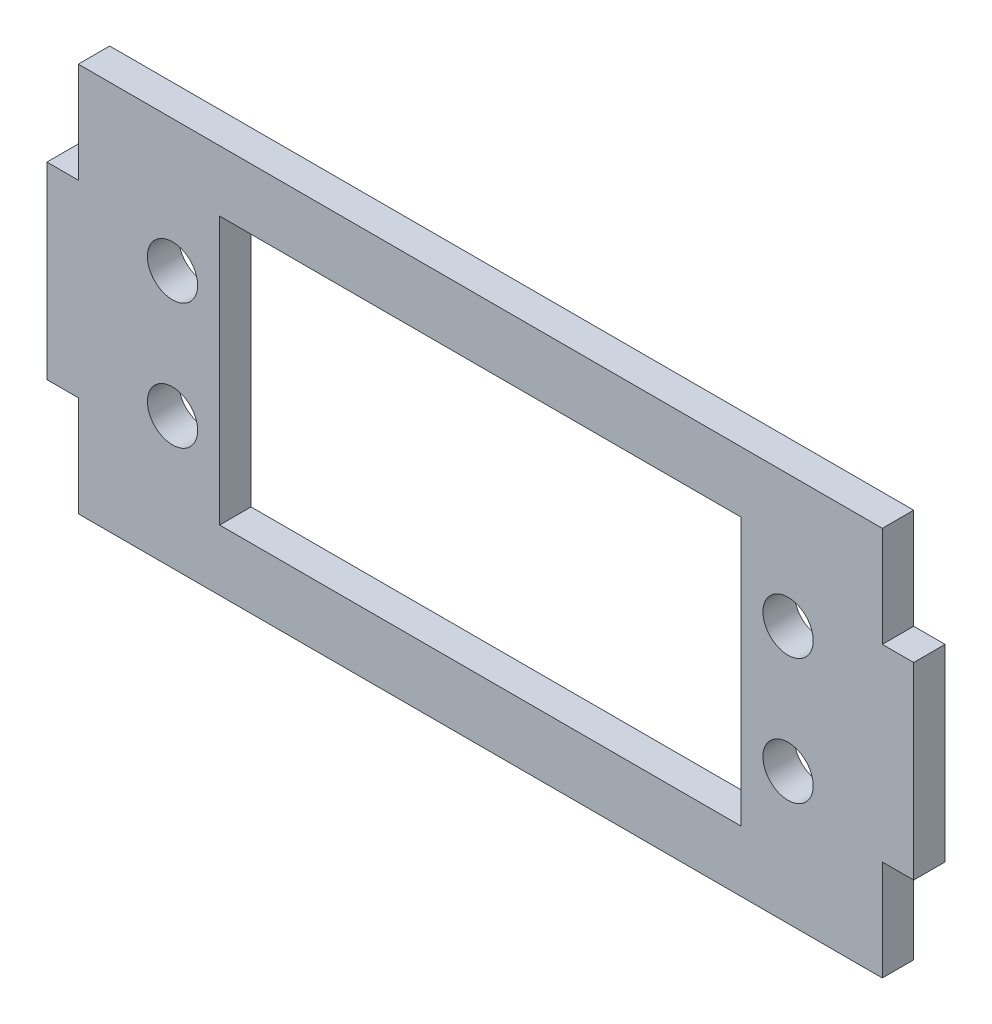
ISO-10303-21;
HEADER;
FILE_DESCRIPTION(('STEP AP214'),'2;1');
FILE_NAME('part.step','',(''),(''),'','','');
FILE_SCHEMA(('AUTOMOTIVE_DESIGN { 1 0 10303 214 1 1 1 1 }'));
ENDSEC;
DATA;
#1=APPLICATION_CONTEXT('core data for automotive mechanical design processes');
#2=APPLICATION_PROTOCOL_DEFINITION('international standard','automotive_design',2000,#1);
#3=PRODUCT_CONTEXT('',#1,'mechanical');
#4=PRODUCT('Part','Part','',(#3));
#5=PRODUCT_RELATED_PRODUCT_CATEGORY('part','',(#4));
#6=PRODUCT_DEFINITION_FORMATION('','',#4);
#7=PRODUCT_DEFINITION_CONTEXT('part definition',#1,'design');
#8=PRODUCT_DEFINITION('design','',#6,#7);
#9=PRODUCT_DEFINITION_SHAPE('','',#8);
#10=(LENGTH_UNIT() NAMED_UNIT(*) SI_UNIT(.MILLI.,.METRE.));
#11=(NAMED_UNIT(*) PLANE_ANGLE_UNIT() SI_UNIT($,.RADIAN.));
#12=(NAMED_UNIT(*) SI_UNIT($,.STERADIAN.) SOLID_ANGLE_UNIT());
#13=UNCERTAINTY_MEASURE_WITH_UNIT(LENGTH_MEASURE(1.E-05),#10,'distance_accuracy_value','');
#14=(GEOMETRIC_REPRESENTATION_CONTEXT(3) GLOBAL_UNCERTAINTY_ASSIGNED_CONTEXT((#13)) GLOBAL_UNIT_ASSIGNED_CONTEXT((#10,
#11,#12)) REPRESENTATION_CONTEXT('',''));
#15=CARTESIAN_POINT('',(0.,0.,0.));
#16=DIRECTION('',(0.,0.,1.));
#17=DIRECTION('',(1.,0.,0.));
#18=AXIS2_PLACEMENT_3D('',#15,#16,#17);
#19=CARTESIAN_POINT('',(0.,0.,2.5));
#20=DIRECTION('',(0.,0.,-1.));
#21=DIRECTION('',(-1.,0.,0.));
#22=AXIS2_PLACEMENT_3D('',#19,#20,#21);
#23=PLANE('',#22);
#24=CARTESIAN_POINT('',(34.5,5.,2.5));
#25=DIRECTION('',(0.,0.,-1.));
#26=DIRECTION('',(-1.,0.,0.));
#27=AXIS2_PLACEMENT_3D('',#24,#25,#26);
#28=CIRCLE('',#27,2.0000000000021);
#29=CARTESIAN_POINT('',(32.4999999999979,5.,2.5));
#30=VERTEX_POINT('',#29);
#31=EDGE_CURVE('E178',#30,#30,#28,.T.);
#32=ORIENTED_EDGE('',*,*,#31,.T.);
#33=EDGE_LOOP('',(#32));
#34=FACE_BOUND('',#33,.T.);
#35=CARTESIAN_POINT('',(34.5,-5.,2.5));
#36=DIRECTION('',(0.,0.,-1.));
#37=DIRECTION('',(-1.,0.,0.));
#38=AXIS2_PLACEMENT_3D('',#35,#36,#37);
#39=CIRCLE('',#38,2.);
#40=CARTESIAN_POINT('',(32.5,-5.,2.5));
#41=VERTEX_POINT('',#40);
#42=EDGE_CURVE('E566',#41,#41,#39,.T.);
#43=ORIENTED_EDGE('',*,*,#42,.T.);
#44=EDGE_LOOP('',(#43));
#45=FACE_BOUND('',#44,.T.);
#46=CARTESIAN_POINT('',(-14.5,-5.,2.5));
#47=DIRECTION('',(0.,0.,-1.));
#48=DIRECTION('',(-1.,0.,0.));
#49=AXIS2_PLACEMENT_3D('',#46,#47,#48);
#50=CIRCLE('',#49,2.);
#51=CARTESIAN_POINT('',(-16.5,-5.,2.5));
#52=VERTEX_POINT('',#51);
#53=EDGE_CURVE('E568',#52,#52,#50,.T.);
#54=ORIENTED_EDGE('',*,*,#53,.T.);
#55=EDGE_LOOP('',(#54));
#56=FACE_BOUND('',#55,.T.);
#57=CARTESIAN_POINT('',(-14.5,5.,2.5));
#58=DIRECTION('',(0.,0.,-1.));
#59=DIRECTION('',(-1.,0.,0.));
#60=AXIS2_PLACEMENT_3D('',#57,#58,#59);
#61=CIRCLE('',#60,2.0000000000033);
#62=CARTESIAN_POINT('',(-16.5000000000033,5.,2.5));
#63=VERTEX_POINT('',#62);
#64=EDGE_CURVE('E573',#63,#63,#61,.T.);
#65=ORIENTED_EDGE('',*,*,#64,.T.);
#66=EDGE_LOOP('',(#65));
#67=FACE_BOUND('',#66,.T.);
#68=DIRECTION('',(0.,-1.,0.));
#69=VECTOR('',#68,1.);
#70=CARTESIAN_POINT('',(-22.,15.5,2.5));
#71=LINE('',#70,#69);
#72=CARTESIAN_POINT('',(-22.,15.5,2.5));
#73=VERTEX_POINT('',#72);
#74=CARTESIAN_POINT('',(-22.,7.5,2.5));
#75=VERTEX_POINT('',#74);
#76=EDGE_CURVE('E188',#73,#75,#71,.T.);
#77=ORIENTED_EDGE('',*,*,#76,.T.);
#78=DIRECTION('',(-1.,0.,0.));
#79=VECTOR('',#78,1.);
#80=CARTESIAN_POINT('',(-22.,7.5,2.5));
#81=LINE('',#80,#79);
#82=CARTESIAN_POINT('',(-24.5,7.5,2.5));
#83=VERTEX_POINT('',#82);
#84=EDGE_CURVE('E191',#75,#83,#81,.T.);
#85=ORIENTED_EDGE('',*,*,#84,.T.);
#86=DIRECTION('',(0.,-1.,0.));
#87=VECTOR('',#86,1.);
#88=CARTESIAN_POINT('',(-24.5,7.5,2.5));
#89=LINE('',#88,#87);
#90=CARTESIAN_POINT('',(-24.5,-7.5,2.5));
#91=VERTEX_POINT('',#90);
#92=EDGE_CURVE('E194',#83,#91,#89,.T.);
#93=ORIENTED_EDGE('',*,*,#92,.T.);
#94=DIRECTION('',(1.,0.,0.));
#95=VECTOR('',#94,1.);
#96=CARTESIAN_POINT('',(-22.,-7.5,2.5));
#97=LINE('',#96,#95);
#98=CARTESIAN_POINT('',(-22.,-7.5,2.5));
#99=VERTEX_POINT('',#98);
#100=EDGE_CURVE('E196',#91,#99,#97,.T.);
#101=ORIENTED_EDGE('',*,*,#100,.T.);
#102=DIRECTION('',(0.,-1.,0.));
#103=VECTOR('',#102,1.);
#104=CARTESIAN_POINT('',(-22.,-7.5,2.5));
#105=LINE('',#104,#103);
#106=CARTESIAN_POINT('',(-22.,-15.5,2.5));
#107=VERTEX_POINT('',#106);
#108=EDGE_CURVE('E198',#99,#107,#105,.T.);
#109=ORIENTED_EDGE('',*,*,#108,.T.);
#110=DIRECTION('',(1.,0.,0.));
#111=VECTOR('',#110,1.);
#112=CARTESIAN_POINT('',(-22.,-15.5,2.5));
#113=LINE('',#112,#111);
#114=CARTESIAN_POINT('',(42.,-15.5,2.5));
#115=VERTEX_POINT('',#114);
#116=EDGE_CURVE('E200',#107,#115,#113,.T.);
#117=ORIENTED_EDGE('',*,*,#116,.T.);
#118=DIRECTION('',(0.,1.,0.));
#119=VECTOR('',#118,1.);
#120=CARTESIAN_POINT('',(42.,-7.49999999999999,2.5));
#121=LINE('',#120,#119);
#122=CARTESIAN_POINT('',(42.,-7.49999999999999,2.5));
#123=VERTEX_POINT('',#122);
#124=EDGE_CURVE('E202',#115,#123,#121,.T.);
#125=ORIENTED_EDGE('',*,*,#124,.T.);
#126=DIRECTION('',(1.,0.,0.));
#127=VECTOR('',#126,1.);
#128=CARTESIAN_POINT('',(42.,-7.49999999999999,2.5));
#129=LINE('',#128,#127);
#130=CARTESIAN_POINT('',(44.5,-7.49999999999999,2.5));
#131=VERTEX_POINT('',#130);
#132=EDGE_CURVE('E204',#123,#131,#129,.T.);
#133=ORIENTED_EDGE('',*,*,#132,.T.);
#134=DIRECTION('',(0.,1.,0.));
#135=VECTOR('',#134,1.);
#136=CARTESIAN_POINT('',(44.5,7.50000000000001,2.5));
#137=LINE('',#136,#135);
#138=CARTESIAN_POINT('',(44.5,7.50000000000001,2.5));
#139=VERTEX_POINT('',#138);
#140=EDGE_CURVE('E206',#131,#139,#137,.T.);
#141=ORIENTED_EDGE('',*,*,#140,.T.);
#142=DIRECTION('',(-1.,0.,0.));
#143=VECTOR('',#142,1.);
#144=CARTESIAN_POINT('',(42.,7.50000000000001,2.5));
#145=LINE('',#144,#143);
#146=CARTESIAN_POINT('',(42.,7.50000000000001,2.5));
#147=VERTEX_POINT('',#146);
#148=EDGE_CURVE('E208',#139,#147,#145,.T.);
#149=ORIENTED_EDGE('',*,*,#148,.T.);
#150=DIRECTION('',(0.,1.,0.));
#151=VECTOR('',#150,1.);
#152=CARTESIAN_POINT('',(42.,15.5,2.5));
#153=LINE('',#152,#151);
#154=CARTESIAN_POINT('',(42.,15.5,2.5));
#155=VERTEX_POINT('',#154);
#156=EDGE_CURVE('E210',#147,#155,#153,.T.);
#157=ORIENTED_EDGE('',*,*,#156,.T.);
#158=DIRECTION('',(-1.,0.,0.));
#159=VECTOR('',#158,1.);
#160=CARTESIAN_POINT('',(-22.,15.5,2.5));
#161=LINE('',#160,#159);
#162=EDGE_CURVE('E212',#155,#73,#161,.T.);
#163=ORIENTED_EDGE('',*,*,#162,.T.);
#164=EDGE_LOOP('',(#77,#85,#93,#101,#109,#117,#125,#133,#141,#149,#157,#163));
#165=FACE_BOUND('',#164,.T.);
#166=DIRECTION('',(0.,-1.,0.));
#167=VECTOR('',#166,1.);
#168=CARTESIAN_POINT('',(-10.749101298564,10.649101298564,2.5));
#169=LINE('',#168,#167);
#170=CARTESIAN_POINT('',(-10.749101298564,10.649101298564,2.5));
#171=VERTEX_POINT('',#170);
#172=CARTESIAN_POINT('',(-10.749101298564,-10.64910129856,2.5));
#173=VERTEX_POINT('',#172);
#174=EDGE_CURVE('E150',#171,#173,#169,.T.);
#175=ORIENTED_EDGE('',*,*,#174,.F.);
#176=DIRECTION('',(-1.,0.,0.));
#177=VECTOR('',#176,1.);
#178=CARTESIAN_POINT('',(-10.749101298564,10.649101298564,2.5));
#179=LINE('',#178,#177);
#180=CARTESIAN_POINT('',(30.74910129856,10.649101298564,2.5));
#181=VERTEX_POINT('',#180);
#182=EDGE_CURVE('E172',#181,#171,#179,.T.);
#183=ORIENTED_EDGE('',*,*,#182,.F.);
#184=DIRECTION('',(0.,1.,0.));
#185=VECTOR('',#184,1.);
#186=CARTESIAN_POINT('',(30.74910129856,10.649101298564,2.5));
#187=LINE('',#186,#185);
#188=CARTESIAN_POINT('',(30.74910129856,-10.64910129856,2.5));
#189=VERTEX_POINT('',#188);
#190=EDGE_CURVE('E170',#189,#181,#187,.T.);
#191=ORIENTED_EDGE('',*,*,#190,.F.);
#192=DIRECTION('',(1.,0.,0.));
#193=VECTOR('',#192,1.);
#194=CARTESIAN_POINT('',(-10.749101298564,-10.64910129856,2.5));
#195=LINE('',#194,#193);
#196=EDGE_CURVE('E158',#173,#189,#195,.T.);
#197=ORIENTED_EDGE('',*,*,#196,.F.);
#198=EDGE_LOOP('',(#175,#183,#191,#197));
#199=FACE_BOUND('',#198,.T.);
#200=ADVANCED_FACE('F37',(#34,#45,#56,#67,#165,#199),#23,.F.);
#201=CARTESIAN_POINT('',(0.,0.,0.));
#202=DIRECTION('',(0.,0.,-1.));
#203=DIRECTION('',(-1.,0.,0.));
#204=AXIS2_PLACEMENT_3D('',#201,#202,#203);
#205=PLANE('',#204);
#206=CARTESIAN_POINT('',(34.5,5.,0.));
#207=DIRECTION('',(0.,0.,-1.));
#208=DIRECTION('',(-1.,0.,0.));
#209=AXIS2_PLACEMENT_3D('',#206,#207,#208);
#210=CIRCLE('',#209,2.0000000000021);
#211=CARTESIAN_POINT('',(32.4999999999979,5.,0.));
#212=VERTEX_POINT('',#211);
#213=EDGE_CURVE('E564',#212,#212,#210,.T.);
#214=ORIENTED_EDGE('',*,*,#213,.F.);
#215=EDGE_LOOP('',(#214));
#216=FACE_BOUND('',#215,.T.);
#217=CARTESIAN_POINT('',(34.5,-5.,0.));
#218=DIRECTION('',(0.,0.,-1.));
#219=DIRECTION('',(-1.,0.,0.));
#220=AXIS2_PLACEMENT_3D('',#217,#218,#219);
#221=CIRCLE('',#220,2.);
#222=CARTESIAN_POINT('',(32.5,-5.,0.));
#223=VERTEX_POINT('',#222);
#224=EDGE_CURVE('E581',#223,#223,#221,.T.);
#225=ORIENTED_EDGE('',*,*,#224,.F.);
#226=EDGE_LOOP('',(#225));
#227=FACE_BOUND('',#226,.T.);
#228=CARTESIAN_POINT('',(-14.5,-5.,0.));
#229=DIRECTION('',(0.,0.,-1.));
#230=DIRECTION('',(-1.,0.,0.));
#231=AXIS2_PLACEMENT_3D('',#228,#229,#230);
#232=CIRCLE('',#231,2.);
#233=CARTESIAN_POINT('',(-16.5,-5.,0.));
#234=VERTEX_POINT('',#233);
#235=EDGE_CURVE('E579',#234,#234,#232,.T.);
#236=ORIENTED_EDGE('',*,*,#235,.F.);
#237=EDGE_LOOP('',(#236));
#238=FACE_BOUND('',#237,.T.);
#239=CARTESIAN_POINT('',(-14.5,5.,0.));
#240=DIRECTION('',(0.,0.,-1.));
#241=DIRECTION('',(-1.,0.,0.));
#242=AXIS2_PLACEMENT_3D('',#239,#240,#241);
#243=CIRCLE('',#242,2.0000000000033);
#244=CARTESIAN_POINT('',(-16.5000000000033,5.,0.));
#245=VERTEX_POINT('',#244);
#246=EDGE_CURVE('E576',#245,#245,#243,.T.);
#247=ORIENTED_EDGE('',*,*,#246,.F.);
#248=EDGE_LOOP('',(#247));
#249=FACE_BOUND('',#248,.T.);
#250=DIRECTION('',(0.,-1.,0.));
#251=VECTOR('',#250,1.);
#252=CARTESIAN_POINT('',(-22.,15.5,0.));
#253=LINE('',#252,#251);
#254=CARTESIAN_POINT('',(-22.,15.5,0.));
#255=VERTEX_POINT('',#254);
#256=CARTESIAN_POINT('',(-22.,7.5,0.));
#257=VERTEX_POINT('',#256);
#258=EDGE_CURVE('E166',#255,#257,#253,.T.);
#259=ORIENTED_EDGE('',*,*,#258,.F.);
#260=DIRECTION('',(-1.,0.,0.));
#261=VECTOR('',#260,1.);
#262=CARTESIAN_POINT('',(-22.,15.5,0.));
#263=LINE('',#262,#261);
#264=CARTESIAN_POINT('',(42.,15.5,0.));
#265=VERTEX_POINT('',#264);
#266=EDGE_CURVE('E192',#265,#255,#263,.T.);
#267=ORIENTED_EDGE('',*,*,#266,.F.);
#268=DIRECTION('',(0.,1.,0.));
#269=VECTOR('',#268,1.);
#270=CARTESIAN_POINT('',(42.,15.5,0.));
#271=LINE('',#270,#269);
#272=CARTESIAN_POINT('',(42.,7.50000000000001,0.));
#273=VERTEX_POINT('',#272);
#274=EDGE_CURVE('E235',#273,#265,#271,.T.);
#275=ORIENTED_EDGE('',*,*,#274,.F.);
#276=DIRECTION('',(-1.,0.,0.));
#277=VECTOR('',#276,1.);
#278=CARTESIAN_POINT('',(42.,7.50000000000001,0.));
#279=LINE('',#278,#277);
#280=CARTESIAN_POINT('',(44.5,7.50000000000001,0.));
#281=VERTEX_POINT('',#280);
#282=EDGE_CURVE('E233',#281,#273,#279,.T.);
#283=ORIENTED_EDGE('',*,*,#282,.F.);
#284=DIRECTION('',(0.,1.,0.));
#285=VECTOR('',#284,1.);
#286=CARTESIAN_POINT('',(44.5,7.50000000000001,0.));
#287=LINE('',#286,#285);
#288=CARTESIAN_POINT('',(44.5,-7.49999999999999,0.));
#289=VERTEX_POINT('',#288);
#290=EDGE_CURVE('E231',#289,#281,#287,.T.);
#291=ORIENTED_EDGE('',*,*,#290,.F.);
#292=DIRECTION('',(1.,0.,0.));
#293=VECTOR('',#292,1.);
#294=CARTESIAN_POINT('',(42.,-7.49999999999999,0.));
#295=LINE('',#294,#293);
#296=CARTESIAN_POINT('',(42.,-7.49999999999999,0.));
#297=VERTEX_POINT('',#296);
#298=EDGE_CURVE('E229',#297,#289,#295,.T.);
#299=ORIENTED_EDGE('',*,*,#298,.F.);
#300=DIRECTION('',(0.,1.,0.));
#301=VECTOR('',#300,1.);
#302=CARTESIAN_POINT('',(42.,-7.49999999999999,0.));
#303=LINE('',#302,#301);
#304=CARTESIAN_POINT('',(42.,-15.5,0.));
#305=VERTEX_POINT('',#304);
#306=EDGE_CURVE('E227',#305,#297,#303,.T.);
#307=ORIENTED_EDGE('',*,*,#306,.F.);
#308=DIRECTION('',(1.,0.,0.));
#309=VECTOR('',#308,1.);
#310=CARTESIAN_POINT('',(-22.,-15.5,0.));
#311=LINE('',#310,#309);
#312=CARTESIAN_POINT('',(-22.,-15.5,0.));
#313=VERTEX_POINT('',#312);
#314=EDGE_CURVE('E225',#313,#305,#311,.T.);
#315=ORIENTED_EDGE('',*,*,#314,.F.);
#316=DIRECTION('',(0.,-1.,0.));
#317=VECTOR('',#316,1.);
#318=CARTESIAN_POINT('',(-22.,-7.5,0.));
#319=LINE('',#318,#317);
#320=CARTESIAN_POINT('',(-22.,-7.5,0.));
#321=VERTEX_POINT('',#320);
#322=EDGE_CURVE('E223',#321,#313,#319,.T.);
#323=ORIENTED_EDGE('',*,*,#322,.F.);
#324=DIRECTION('',(1.,0.,0.));
#325=VECTOR('',#324,1.);
#326=CARTESIAN_POINT('',(-22.,-7.5,0.));
#327=LINE('',#326,#325);
#328=CARTESIAN_POINT('',(-24.5,-7.5,0.));
#329=VERTEX_POINT('',#328);
#330=EDGE_CURVE('E221',#329,#321,#327,.T.);
#331=ORIENTED_EDGE('',*,*,#330,.F.);
#332=DIRECTION('',(0.,-1.,0.));
#333=VECTOR('',#332,1.);
#334=CARTESIAN_POINT('',(-24.5,7.5,0.));
#335=LINE('',#334,#333);
#336=CARTESIAN_POINT('',(-24.5,7.5,0.));
#337=VERTEX_POINT('',#336);
#338=EDGE_CURVE('E219',#337,#329,#335,.T.);
#339=ORIENTED_EDGE('',*,*,#338,.F.);
#340=DIRECTION('',(-1.,0.,0.));
#341=VECTOR('',#340,1.);
#342=CARTESIAN_POINT('',(-22.,7.5,0.));
#343=LINE('',#342,#341);
#344=EDGE_CURVE('E217',#257,#337,#343,.T.);
#345=ORIENTED_EDGE('',*,*,#344,.F.);
#346=EDGE_LOOP('',(#259,#267,#275,#283,#291,#299,#307,#315,#323,#331,#339,#345));
#347=FACE_BOUND('',#346,.T.);
#348=DIRECTION('',(-1.,0.,0.));
#349=VECTOR('',#348,1.);
#350=CARTESIAN_POINT('',(-10.749101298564,10.649101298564,0.));
#351=LINE('',#350,#349);
#352=CARTESIAN_POINT('',(30.74910129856,10.649101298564,0.));
#353=VERTEX_POINT('',#352);
#354=CARTESIAN_POINT('',(-10.749101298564,10.649101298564,0.));
#355=VERTEX_POINT('',#354);
#356=EDGE_CURVE('E159',#353,#355,#351,.T.);
#357=ORIENTED_EDGE('',*,*,#356,.T.);
#358=DIRECTION('',(0.,-1.,0.));
#359=VECTOR('',#358,1.);
#360=CARTESIAN_POINT('',(-10.749101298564,10.649101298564,0.));
#361=LINE('',#360,#359);
#362=CARTESIAN_POINT('',(-10.749101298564,-10.64910129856,0.));
#363=VERTEX_POINT('',#362);
#364=EDGE_CURVE('E60',#355,#363,#361,.T.);
#365=ORIENTED_EDGE('',*,*,#364,.T.);
#366=DIRECTION('',(1.,0.,0.));
#367=VECTOR('',#366,1.);
#368=CARTESIAN_POINT('',(-10.749101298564,-10.64910129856,0.));
#369=LINE('',#368,#367);
#370=CARTESIAN_POINT('',(30.74910129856,-10.64910129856,0.));
#371=VERTEX_POINT('',#370);
#372=EDGE_CURVE('E165',#363,#371,#369,.T.);
#373=ORIENTED_EDGE('',*,*,#372,.T.);
#374=DIRECTION('',(0.,1.,0.));
#375=VECTOR('',#374,1.);
#376=CARTESIAN_POINT('',(30.74910129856,10.649101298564,0.));
#377=LINE('',#376,#375);
#378=EDGE_CURVE('E180',#371,#353,#377,.T.);
#379=ORIENTED_EDGE('',*,*,#378,.T.);
#380=EDGE_LOOP('',(#357,#365,#373,#379));
#381=FACE_BOUND('',#380,.T.);
#382=ADVANCED_FACE('F277',(#216,#227,#238,#249,#347,#381),#205,.T.);
#383=CARTESIAN_POINT('',(-22.,15.5,2.5));
#384=DIRECTION('',(1.,0.,0.));
#385=DIRECTION('',(0.,0.,-1.));
#386=AXIS2_PLACEMENT_3D('',#383,#384,#385);
#387=PLANE('',#386);
#388=ORIENTED_EDGE('',*,*,#258,.T.);
#389=DIRECTION('',(0.,0.,-1.));
#390=VECTOR('',#389,1.);
#391=CARTESIAN_POINT('',(-22.,7.5,2.5));
#392=LINE('',#391,#390);
#393=EDGE_CURVE('E11',#75,#257,#392,.T.);
#394=ORIENTED_EDGE('',*,*,#393,.F.);
#395=ORIENTED_EDGE('',*,*,#76,.F.);
#396=DIRECTION('',(0.,0.,-1.));
#397=VECTOR('',#396,1.);
#398=CARTESIAN_POINT('',(-22.,15.5,2.5));
#399=LINE('',#398,#397);
#400=EDGE_CURVE('E214',#73,#255,#399,.T.);
#401=ORIENTED_EDGE('',*,*,#400,.T.);
#402=EDGE_LOOP('',(#388,#394,#395,#401));
#403=FACE_BOUND('',#402,.T.);
#404=ADVANCED_FACE('F39',(#403),#387,.F.);
#405=CARTESIAN_POINT('',(-22.,7.5,2.5));
#406=DIRECTION('',(0.,-1.,0.));
#407=DIRECTION('',(0.,0.,-1.));
#408=AXIS2_PLACEMENT_3D('',#405,#406,#407);
#409=PLANE('',#408);
#410=ORIENTED_EDGE('',*,*,#344,.T.);
#411=DIRECTION('',(0.,0.,-1.));
#412=VECTOR('',#411,1.);
#413=CARTESIAN_POINT('',(-24.5,7.5,2.5));
#414=LINE('',#413,#412);
#415=EDGE_CURVE('E45',#83,#337,#414,.T.);
#416=ORIENTED_EDGE('',*,*,#415,.F.);
#417=ORIENTED_EDGE('',*,*,#84,.F.);
#418=ORIENTED_EDGE('',*,*,#393,.T.);
#419=EDGE_LOOP('',(#410,#416,#417,#418));
#420=FACE_BOUND('',#419,.T.);
#421=ADVANCED_FACE('F294',(#420),#409,.F.);
#422=CARTESIAN_POINT('',(-24.5,7.5,2.5));
#423=DIRECTION('',(1.,0.,0.));
#424=DIRECTION('',(0.,0.,-1.));
#425=AXIS2_PLACEMENT_3D('',#422,#423,#424);
#426=PLANE('',#425);
#427=ORIENTED_EDGE('',*,*,#338,.T.);
#428=DIRECTION('',(0.,0.,-1.));
#429=VECTOR('',#428,1.);
#430=CARTESIAN_POINT('',(-24.5,-7.5,2.5));
#431=LINE('',#430,#429);
#432=EDGE_CURVE('E264',#91,#329,#431,.T.);
#433=ORIENTED_EDGE('',*,*,#432,.F.);
#434=ORIENTED_EDGE('',*,*,#92,.F.);
#435=ORIENTED_EDGE('',*,*,#415,.T.);
#436=EDGE_LOOP('',(#427,#433,#434,#435));
#437=FACE_BOUND('',#436,.T.);
#438=ADVANCED_FACE('F271',(#437),#426,.F.);
#439=CARTESIAN_POINT('',(-22.,-7.5,2.5));
#440=DIRECTION('',(0.,1.,0.));
#441=DIRECTION('',(0.,0.,1.));
#442=AXIS2_PLACEMENT_3D('',#439,#440,#441);
#443=PLANE('',#442);
#444=ORIENTED_EDGE('',*,*,#330,.T.);
#445=DIRECTION('',(0.,0.,-1.));
#446=VECTOR('',#445,1.);
#447=CARTESIAN_POINT('',(-22.,-7.5,2.5));
#448=LINE('',#447,#446);
#449=EDGE_CURVE('E261',#99,#321,#448,.T.);
#450=ORIENTED_EDGE('',*,*,#449,.F.);
#451=ORIENTED_EDGE('',*,*,#100,.F.);
#452=ORIENTED_EDGE('',*,*,#432,.T.);
#453=EDGE_LOOP('',(#444,#450,#451,#452));
#454=FACE_BOUND('',#453,.T.);
#455=ADVANCED_FACE('F283',(#454),#443,.F.);
#456=CARTESIAN_POINT('',(-22.,-7.5,2.5));
#457=DIRECTION('',(1.,0.,0.));
#458=DIRECTION('',(0.,0.,-1.));
#459=AXIS2_PLACEMENT_3D('',#456,#457,#458);
#460=PLANE('',#459);
#461=ORIENTED_EDGE('',*,*,#322,.T.);
#462=DIRECTION('',(0.,0.,-1.));
#463=VECTOR('',#462,1.);
#464=CARTESIAN_POINT('',(-22.,-15.5,2.5));
#465=LINE('',#464,#463);
#466=EDGE_CURVE('E258',#107,#313,#465,.T.);
#467=ORIENTED_EDGE('',*,*,#466,.F.);
#468=ORIENTED_EDGE('',*,*,#108,.F.);
#469=ORIENTED_EDGE('',*,*,#449,.T.);
#470=EDGE_LOOP('',(#461,#467,#468,#469));
#471=FACE_BOUND('',#470,.T.);
#472=ADVANCED_FACE('F287',(#471),#460,.F.);
#473=CARTESIAN_POINT('',(-22.,-15.5,2.5));
#474=DIRECTION('',(0.,1.,0.));
#475=DIRECTION('',(-1.,0.,0.));
#476=AXIS2_PLACEMENT_3D('',#473,#474,#475);
#477=PLANE('',#476);
#478=ORIENTED_EDGE('',*,*,#314,.T.);
#479=DIRECTION('',(0.,0.,-1.));
#480=VECTOR('',#479,1.);
#481=CARTESIAN_POINT('',(42.,-15.5,2.5));
#482=LINE('',#481,#480);
#483=EDGE_CURVE('E255',#115,#305,#482,.T.);
#484=ORIENTED_EDGE('',*,*,#483,.F.);
#485=ORIENTED_EDGE('',*,*,#116,.F.);
#486=ORIENTED_EDGE('',*,*,#466,.T.);
#487=EDGE_LOOP('',(#478,#484,#485,#486));
#488=FACE_BOUND('',#487,.T.);
#489=ADVANCED_FACE('F327',(#488),#477,.F.);
#490=CARTESIAN_POINT('',(42.,-7.49999999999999,2.5));
#491=DIRECTION('',(-1.,0.,0.));
#492=DIRECTION('',(0.,0.,1.));
#493=AXIS2_PLACEMENT_3D('',#490,#491,#492);
#494=PLANE('',#493);
#495=ORIENTED_EDGE('',*,*,#306,.T.);
#496=DIRECTION('',(0.,0.,-1.));
#497=VECTOR('',#496,1.);
#498=CARTESIAN_POINT('',(42.,-7.49999999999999,2.5));
#499=LINE('',#498,#497);
#500=EDGE_CURVE('E252',#123,#297,#499,.T.);
#501=ORIENTED_EDGE('',*,*,#500,.F.);
#502=ORIENTED_EDGE('',*,*,#124,.F.);
#503=ORIENTED_EDGE('',*,*,#483,.T.);
#504=EDGE_LOOP('',(#495,#501,#502,#503));
#505=FACE_BOUND('',#504,.T.);
#506=ADVANCED_FACE('F325',(#505),#494,.F.);
#507=CARTESIAN_POINT('',(42.,-7.49999999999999,2.5));
#508=DIRECTION('',(0.,1.,0.));
#509=DIRECTION('',(-1.,0.,0.));
#510=AXIS2_PLACEMENT_3D('',#507,#508,#509);
#511=PLANE('',#510);
#512=ORIENTED_EDGE('',*,*,#298,.T.);
#513=DIRECTION('',(0.,0.,-1.));
#514=VECTOR('',#513,1.);
#515=CARTESIAN_POINT('',(44.5,-7.49999999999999,2.5));
#516=LINE('',#515,#514);
#517=EDGE_CURVE('E249',#131,#289,#516,.T.);
#518=ORIENTED_EDGE('',*,*,#517,.F.);
#519=ORIENTED_EDGE('',*,*,#132,.F.);
#520=ORIENTED_EDGE('',*,*,#500,.T.);
#521=EDGE_LOOP('',(#512,#518,#519,#520));
#522=FACE_BOUND('',#521,.T.);
#523=ADVANCED_FACE('F321',(#522),#511,.F.);
#524=CARTESIAN_POINT('',(44.5,7.50000000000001,2.5));
#525=DIRECTION('',(-1.,0.,0.));
#526=DIRECTION('',(0.,0.,1.));
#527=AXIS2_PLACEMENT_3D('',#524,#525,#526);
#528=PLANE('',#527);
#529=ORIENTED_EDGE('',*,*,#290,.T.);
#530=DIRECTION('',(0.,0.,-1.));
#531=VECTOR('',#530,1.);
#532=CARTESIAN_POINT('',(44.5,7.50000000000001,2.5));
#533=LINE('',#532,#531);
#534=EDGE_CURVE('E246',#139,#281,#533,.T.);
#535=ORIENTED_EDGE('',*,*,#534,.F.);
#536=ORIENTED_EDGE('',*,*,#140,.F.);
#537=ORIENTED_EDGE('',*,*,#517,.T.);
#538=EDGE_LOOP('',(#529,#535,#536,#537));
#539=FACE_BOUND('',#538,.T.);
#540=ADVANCED_FACE('F316',(#539),#528,.F.);
#541=CARTESIAN_POINT('',(42.,7.50000000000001,2.5));
#542=DIRECTION('',(0.,-1.,0.));
#543=DIRECTION('',(0.,0.,-1.));
#544=AXIS2_PLACEMENT_3D('',#541,#542,#543);
#545=PLANE('',#544);
#546=ORIENTED_EDGE('',*,*,#282,.T.);
#547=DIRECTION('',(0.,0.,-1.));
#548=VECTOR('',#547,1.);
#549=CARTESIAN_POINT('',(42.,7.50000000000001,2.5));
#550=LINE('',#549,#548);
#551=EDGE_CURVE('E243',#147,#273,#550,.T.);
#552=ORIENTED_EDGE('',*,*,#551,.F.);
#553=ORIENTED_EDGE('',*,*,#148,.F.);
#554=ORIENTED_EDGE('',*,*,#534,.T.);
#555=EDGE_LOOP('',(#546,#552,#553,#554));
#556=FACE_BOUND('',#555,.T.);
#557=ADVANCED_FACE('F310',(#556),#545,.F.);
#558=CARTESIAN_POINT('',(42.,15.5,2.5));
#559=DIRECTION('',(-1.,0.,0.));
#560=DIRECTION('',(0.,0.,1.));
#561=AXIS2_PLACEMENT_3D('',#558,#559,#560);
#562=PLANE('',#561);
#563=ORIENTED_EDGE('',*,*,#274,.T.);
#564=DIRECTION('',(0.,0.,-1.));
#565=VECTOR('',#564,1.);
#566=CARTESIAN_POINT('',(42.,15.5,2.5));
#567=LINE('',#566,#565);
#568=EDGE_CURVE('E240',#155,#265,#567,.T.);
#569=ORIENTED_EDGE('',*,*,#568,.F.);
#570=ORIENTED_EDGE('',*,*,#156,.F.);
#571=ORIENTED_EDGE('',*,*,#551,.T.);
#572=EDGE_LOOP('',(#563,#569,#570,#571));
#573=FACE_BOUND('',#572,.T.);
#574=ADVANCED_FACE('F306',(#573),#562,.F.);
#575=CARTESIAN_POINT('',(-22.,15.5,2.5));
#576=DIRECTION('',(0.,-1.,0.));
#577=DIRECTION('',(1.,0.,0.));
#578=AXIS2_PLACEMENT_3D('',#575,#576,#577);
#579=PLANE('',#578);
#580=ORIENTED_EDGE('',*,*,#266,.T.);
#581=ORIENTED_EDGE('',*,*,#400,.F.);
#582=ORIENTED_EDGE('',*,*,#162,.F.);
#583=ORIENTED_EDGE('',*,*,#568,.T.);
#584=EDGE_LOOP('',(#580,#581,#582,#583));
#585=FACE_BOUND('',#584,.T.);
#586=ADVANCED_FACE('F301',(#585),#579,.F.);
#587=CARTESIAN_POINT('',(-10.749101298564,10.649101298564,2.5));
#588=DIRECTION('',(1.,0.,0.));
#589=DIRECTION('',(0.,1.,0.));
#590=AXIS2_PLACEMENT_3D('',#587,#588,#589);
#591=PLANE('',#590);
#592=ORIENTED_EDGE('',*,*,#364,.F.);
#593=DIRECTION('',(0.,0.,-1.));
#594=VECTOR('',#593,1.);
#595=CARTESIAN_POINT('',(-10.749101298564,10.649101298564,2.5));
#596=LINE('',#595,#594);
#597=EDGE_CURVE('E154',#171,#355,#596,.T.);
#598=ORIENTED_EDGE('',*,*,#597,.F.);
#599=ORIENTED_EDGE('',*,*,#174,.T.);
#600=DIRECTION('',(0.,0.,-1.));
#601=VECTOR('',#600,1.);
#602=CARTESIAN_POINT('',(-10.749101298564,-10.64910129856,2.5));
#603=LINE('',#602,#601);
#604=EDGE_CURVE('E153',#173,#363,#603,.T.);
#605=ORIENTED_EDGE('',*,*,#604,.T.);
#606=EDGE_LOOP('',(#592,#598,#599,#605));
#607=FACE_BOUND('',#606,.T.);
#608=ADVANCED_FACE('F152',(#607),#591,.T.);
#609=CARTESIAN_POINT('',(-10.749101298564,-10.64910129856,2.5));
#610=DIRECTION('',(0.,1.,0.));
#611=DIRECTION('',(0.,0.,1.));
#612=AXIS2_PLACEMENT_3D('',#609,#610,#611);
#613=PLANE('',#612);
#614=ORIENTED_EDGE('',*,*,#372,.F.);
#615=ORIENTED_EDGE('',*,*,#604,.F.);
#616=ORIENTED_EDGE('',*,*,#196,.T.);
#617=DIRECTION('',(0.,0.,-1.));
#618=VECTOR('',#617,1.);
#619=CARTESIAN_POINT('',(30.74910129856,-10.64910129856,2.5));
#620=LINE('',#619,#618);
#621=EDGE_CURVE('E167',#189,#371,#620,.T.);
#622=ORIENTED_EDGE('',*,*,#621,.T.);
#623=EDGE_LOOP('',(#614,#615,#616,#622));
#624=FACE_BOUND('',#623,.T.);
#625=ADVANCED_FACE('F162',(#624),#613,.T.);
#626=CARTESIAN_POINT('',(30.74910129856,10.649101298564,2.5));
#627=DIRECTION('',(-1.,0.,0.));
#628=DIRECTION('',(0.,-1.,0.));
#629=AXIS2_PLACEMENT_3D('',#626,#627,#628);
#630=PLANE('',#629);
#631=ORIENTED_EDGE('',*,*,#378,.F.);
#632=ORIENTED_EDGE('',*,*,#621,.F.);
#633=ORIENTED_EDGE('',*,*,#190,.T.);
#634=DIRECTION('',(0.,0.,-1.));
#635=VECTOR('',#634,1.);
#636=CARTESIAN_POINT('',(30.74910129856,10.649101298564,2.5));
#637=LINE('',#636,#635);
#638=EDGE_CURVE('E52',#181,#353,#637,.T.);
#639=ORIENTED_EDGE('',*,*,#638,.T.);
#640=EDGE_LOOP('',(#631,#632,#633,#639));
#641=FACE_BOUND('',#640,.T.);
#642=ADVANCED_FACE('F389',(#641),#630,.T.);
#643=CARTESIAN_POINT('',(-10.749101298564,10.649101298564,2.5));
#644=DIRECTION('',(0.,-1.,0.));
#645=DIRECTION('',(0.,0.,-1.));
#646=AXIS2_PLACEMENT_3D('',#643,#644,#645);
#647=PLANE('',#646);
#648=ORIENTED_EDGE('',*,*,#356,.F.);
#649=ORIENTED_EDGE('',*,*,#638,.F.);
#650=ORIENTED_EDGE('',*,*,#182,.T.);
#651=ORIENTED_EDGE('',*,*,#597,.T.);
#652=EDGE_LOOP('',(#648,#649,#650,#651));
#653=FACE_BOUND('',#652,.T.);
#654=ADVANCED_FACE('F395',(#653),#647,.T.);
#655=CARTESIAN_POINT('',(-14.5,5.,10.));
#656=DIRECTION('',(0.,0.,-1.));
#657=DIRECTION('',(-1.,0.,0.));
#658=AXIS2_PLACEMENT_3D('',#655,#656,#657);
#659=CYLINDRICAL_SURFACE('',#658,2.0000000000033);
#660=ORIENTED_EDGE('',*,*,#246,.T.);
#661=EDGE_LOOP('',(#660));
#662=FACE_BOUND('',#661,.T.);
#663=ORIENTED_EDGE('',*,*,#64,.F.);
#664=EDGE_LOOP('',(#663));
#665=FACE_BOUND('',#664,.T.);
#666=ADVANCED_FACE('F403',(#662,#665),#659,.F.);
#667=CARTESIAN_POINT('',(-14.5,-5.,10.));
#668=DIRECTION('',(0.,0.,-1.));
#669=DIRECTION('',(-1.,0.,0.));
#670=AXIS2_PLACEMENT_3D('',#667,#668,#669);
#671=CYLINDRICAL_SURFACE('',#670,2.);
#672=ORIENTED_EDGE('',*,*,#235,.T.);
#673=EDGE_LOOP('',(#672));
#674=FACE_BOUND('',#673,.T.);
#675=ORIENTED_EDGE('',*,*,#53,.F.);
#676=EDGE_LOOP('',(#675));
#677=FACE_BOUND('',#676,.T.);
#678=ADVANCED_FACE('F410',(#674,#677),#671,.F.);
#679=CARTESIAN_POINT('',(34.5,-5.,10.));
#680=DIRECTION('',(0.,0.,-1.));
#681=DIRECTION('',(-1.,0.,0.));
#682=AXIS2_PLACEMENT_3D('',#679,#680,#681);
#683=CYLINDRICAL_SURFACE('',#682,2.);
#684=ORIENTED_EDGE('',*,*,#224,.T.);
#685=EDGE_LOOP('',(#684));
#686=FACE_BOUND('',#685,.T.);
#687=ORIENTED_EDGE('',*,*,#42,.F.);
#688=EDGE_LOOP('',(#687));
#689=FACE_BOUND('',#688,.T.);
#690=ADVANCED_FACE('F419',(#686,#689),#683,.F.);
#691=CARTESIAN_POINT('',(34.5,5.,10.));
#692=DIRECTION('',(0.,0.,-1.));
#693=DIRECTION('',(-1.,0.,0.));
#694=AXIS2_PLACEMENT_3D('',#691,#692,#693);
#695=CYLINDRICAL_SURFACE('',#694,2.0000000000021);
#696=ORIENTED_EDGE('',*,*,#213,.T.);
#697=EDGE_LOOP('',(#696));
#698=FACE_BOUND('',#697,.T.);
#699=ORIENTED_EDGE('',*,*,#31,.F.);
#700=EDGE_LOOP('',(#699));
#701=FACE_BOUND('',#700,.T.);
#702=ADVANCED_FACE('F427',(#698,#701),#695,.F.);
#703=CLOSED_SHELL('',(#200,#382,#404,#421,#438,#455,#472,#489,#506,#523,#540,#557,#574,#586,
#608,#625,#642,#654,#666,#678,#690,#702));
#704=MANIFOLD_SOLID_BREP('B2',#703);
#705=ADVANCED_BREP_SHAPE_REPRESENTATION('',(#18,#704),#14);
#706=SHAPE_DEFINITION_REPRESENTATION(#9,#705);
ENDSEC;
END-ISO-10303-21;
